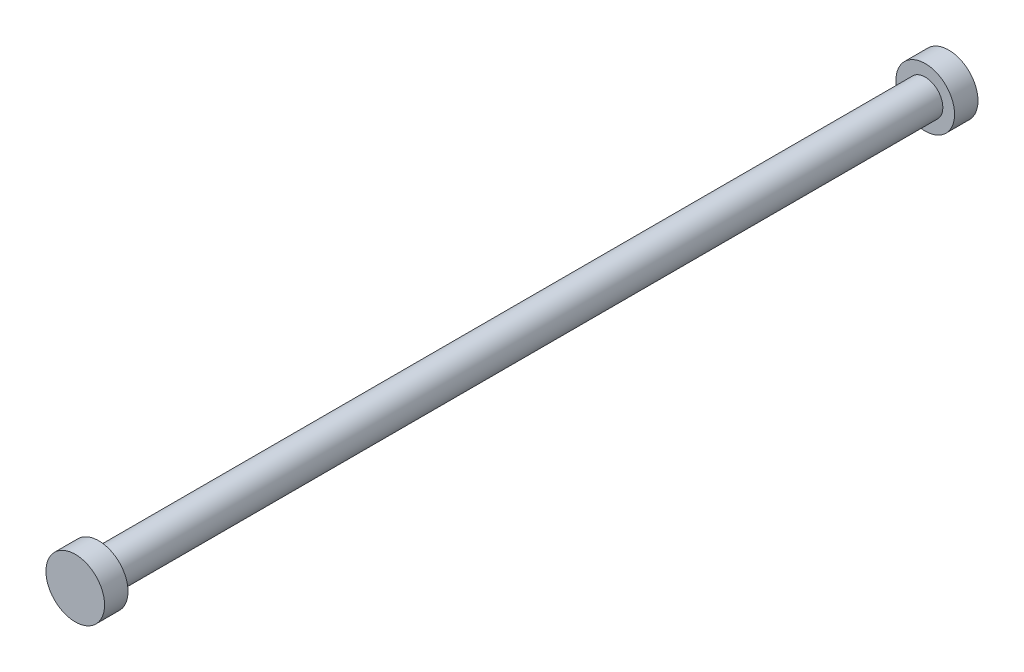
ISO-10303-21;
HEADER;
FILE_DESCRIPTION(('STEP AP214'),'2;1');
FILE_NAME('part.step','',(''),(''),'','','');
FILE_SCHEMA(('AUTOMOTIVE_DESIGN { 1 0 10303 214 1 1 1 1 }'));
ENDSEC;
DATA;
#1=APPLICATION_CONTEXT('core data for automotive mechanical design processes');
#2=APPLICATION_PROTOCOL_DEFINITION('international standard','automotive_design',2000,#1);
#3=PRODUCT_CONTEXT('',#1,'mechanical');
#4=PRODUCT('Part','Part','',(#3));
#5=PRODUCT_RELATED_PRODUCT_CATEGORY('part','',(#4));
#6=PRODUCT_DEFINITION_FORMATION('','',#4);
#7=PRODUCT_DEFINITION_CONTEXT('part definition',#1,'design');
#8=PRODUCT_DEFINITION('design','',#6,#7);
#9=PRODUCT_DEFINITION_SHAPE('','',#8);
#10=(LENGTH_UNIT() NAMED_UNIT(*) SI_UNIT(.MILLI.,.METRE.));
#11=(NAMED_UNIT(*) PLANE_ANGLE_UNIT() SI_UNIT($,.RADIAN.));
#12=(NAMED_UNIT(*) SI_UNIT($,.STERADIAN.) SOLID_ANGLE_UNIT());
#13=UNCERTAINTY_MEASURE_WITH_UNIT(LENGTH_MEASURE(1.E-05),#10,'distance_accuracy_value','');
#14=(GEOMETRIC_REPRESENTATION_CONTEXT(3) GLOBAL_UNCERTAINTY_ASSIGNED_CONTEXT((#13)) GLOBAL_UNIT_ASSIGNED_CONTEXT((#10,
#11,#12)) REPRESENTATION_CONTEXT('',''));
#15=CARTESIAN_POINT('',(0.,0.,0.));
#16=DIRECTION('',(0.,0.,1.));
#17=DIRECTION('',(1.,0.,0.));
#18=AXIS2_PLACEMENT_3D('',#15,#16,#17);
#19=CARTESIAN_POINT('',(0.,0.,-149.));
#20=DIRECTION('',(0.,0.,1.));
#21=DIRECTION('',(1.,0.,0.));
#22=AXIS2_PLACEMENT_3D('',#19,#20,#21);
#23=CYLINDRICAL_SURFACE('',#22,10.);
#24=CARTESIAN_POINT('',(0.,0.,-149.));
#25=DIRECTION('',(0.,0.,1.));
#26=DIRECTION('',(1.,0.,0.));
#27=AXIS2_PLACEMENT_3D('',#24,#25,#26);
#28=CIRCLE('',#27,10.);
#29=CARTESIAN_POINT('',(10.,0.,-149.));
#30=VERTEX_POINT('',#29);
#31=EDGE_CURVE('E10',#30,#30,#28,.T.);
#32=ORIENTED_EDGE('',*,*,#31,.T.);
#33=EDGE_LOOP('',(#32));
#34=FACE_BOUND('',#33,.T.);
#35=CARTESIAN_POINT('',(0.,0.,-141.));
#36=DIRECTION('',(0.,0.,1.));
#37=DIRECTION('',(1.,0.,0.));
#38=AXIS2_PLACEMENT_3D('',#35,#36,#37);
#39=CIRCLE('',#38,10.);
#40=CARTESIAN_POINT('',(10.,0.,-141.));
#41=VERTEX_POINT('',#40);
#42=EDGE_CURVE('E43',#41,#41,#39,.F.);
#43=ORIENTED_EDGE('',*,*,#42,.T.);
#44=EDGE_LOOP('',(#43));
#45=FACE_BOUND('',#44,.T.);
#46=ADVANCED_FACE('F39',(#34,#45),#23,.T.);
#47=CARTESIAN_POINT('',(0.,0.,-149.));
#48=DIRECTION('',(0.,0.,1.));
#49=DIRECTION('',(1.,0.,0.));
#50=AXIS2_PLACEMENT_3D('',#47,#48,#49);
#51=PLANE('',#50);
#52=ORIENTED_EDGE('',*,*,#31,.F.);
#53=EDGE_LOOP('',(#52));
#54=FACE_BOUND('',#53,.T.);
#55=ADVANCED_FACE('F84',(#54),#51,.F.);
#56=CARTESIAN_POINT('',(0.,0.,-141.));
#57=DIRECTION('',(0.,0.,1.));
#58=DIRECTION('',(1.,0.,0.));
#59=AXIS2_PLACEMENT_3D('',#56,#57,#58);
#60=PLANE('',#59);
#61=ORIENTED_EDGE('',*,*,#42,.F.);
#62=EDGE_LOOP('',(#61));
#63=FACE_BOUND('',#62,.T.);
#64=CARTESIAN_POINT('',(0.,0.,-141.));
#65=DIRECTION('',(0.,0.,1.));
#66=DIRECTION('',(1.,0.,0.));
#67=AXIS2_PLACEMENT_3D('',#64,#65,#66);
#68=CIRCLE('',#67,6.);
#69=CARTESIAN_POINT('',(6.,0.,-141.));
#70=VERTEX_POINT('',#69);
#71=EDGE_CURVE('E58',#70,#70,#68,.T.);
#72=ORIENTED_EDGE('',*,*,#71,.F.);
#73=EDGE_LOOP('',(#72));
#74=FACE_BOUND('',#73,.T.);
#75=ADVANCED_FACE('F80',(#63,#74),#60,.T.);
#76=CARTESIAN_POINT('',(0.,0.,141.));
#77=DIRECTION('',(0.,0.,1.));
#78=DIRECTION('',(1.,0.,0.));
#79=AXIS2_PLACEMENT_3D('',#76,#77,#78);
#80=PLANE('',#79);
#81=CARTESIAN_POINT('',(0.,0.,141.));
#82=DIRECTION('',(0.,0.,1.));
#83=DIRECTION('',(1.,0.,0.));
#84=AXIS2_PLACEMENT_3D('',#81,#82,#83);
#85=CIRCLE('',#84,10.);
#86=CARTESIAN_POINT('',(10.,0.,141.));
#87=VERTEX_POINT('',#86);
#88=EDGE_CURVE('E56',#87,#87,#85,.F.);
#89=ORIENTED_EDGE('',*,*,#88,.T.);
#90=EDGE_LOOP('',(#89));
#91=FACE_BOUND('',#90,.T.);
#92=CARTESIAN_POINT('',(0.,0.,141.));
#93=DIRECTION('',(0.,0.,1.));
#94=DIRECTION('',(1.,0.,0.));
#95=AXIS2_PLACEMENT_3D('',#92,#93,#94);
#96=CIRCLE('',#95,6.);
#97=CARTESIAN_POINT('',(6.,0.,141.));
#98=VERTEX_POINT('',#97);
#99=EDGE_CURVE('E54',#98,#98,#96,.T.);
#100=ORIENTED_EDGE('',*,*,#99,.T.);
#101=EDGE_LOOP('',(#100));
#102=FACE_BOUND('',#101,.T.);
#103=ADVANCED_FACE('F68',(#91,#102),#80,.F.);
#104=CARTESIAN_POINT('',(0.,0.,-141.));
#105=DIRECTION('',(0.,0.,1.));
#106=DIRECTION('',(1.,0.,0.));
#107=AXIS2_PLACEMENT_3D('',#104,#105,#106);
#108=CYLINDRICAL_SURFACE('',#107,6.);
#109=ORIENTED_EDGE('',*,*,#71,.T.);
#110=EDGE_LOOP('',(#109));
#111=FACE_BOUND('',#110,.T.);
#112=ORIENTED_EDGE('',*,*,#99,.F.);
#113=EDGE_LOOP('',(#112));
#114=FACE_BOUND('',#113,.T.);
#115=ADVANCED_FACE('F70',(#111,#114),#108,.T.);
#116=CARTESIAN_POINT('',(0.,0.,149.));
#117=DIRECTION('',(0.,0.,1.));
#118=DIRECTION('',(1.,0.,0.));
#119=AXIS2_PLACEMENT_3D('',#116,#117,#118);
#120=PLANE('',#119);
#121=CARTESIAN_POINT('',(0.,0.,149.));
#122=DIRECTION('',(0.,0.,1.));
#123=DIRECTION('',(1.,0.,0.));
#124=AXIS2_PLACEMENT_3D('',#121,#122,#123);
#125=CIRCLE('',#124,10.);
#126=CARTESIAN_POINT('',(10.,0.,149.));
#127=VERTEX_POINT('',#126);
#128=EDGE_CURVE('E47',#127,#127,#125,.T.);
#129=ORIENTED_EDGE('',*,*,#128,.T.);
#130=EDGE_LOOP('',(#129));
#131=FACE_BOUND('',#130,.T.);
#132=ADVANCED_FACE('F72',(#131),#120,.T.);
#133=ORIENTED_EDGE('',*,*,#88,.F.);
#134=EDGE_LOOP('',(#133));
#135=FACE_BOUND('',#134,.T.);
#136=ORIENTED_EDGE('',*,*,#128,.F.);
#137=EDGE_LOOP('',(#136));
#138=FACE_BOUND('',#137,.T.);
#139=ADVANCED_FACE('F41',(#135,#138),#23,.T.);
#140=CLOSED_SHELL('',(#46,#55,#75,#103,#115,#132,#139));
#141=MANIFOLD_SOLID_BREP('B2',#140);
#142=ADVANCED_BREP_SHAPE_REPRESENTATION('',(#18,#141),#14);
#143=SHAPE_DEFINITION_REPRESENTATION(#9,#142);
ENDSEC;
END-ISO-10303-21;
